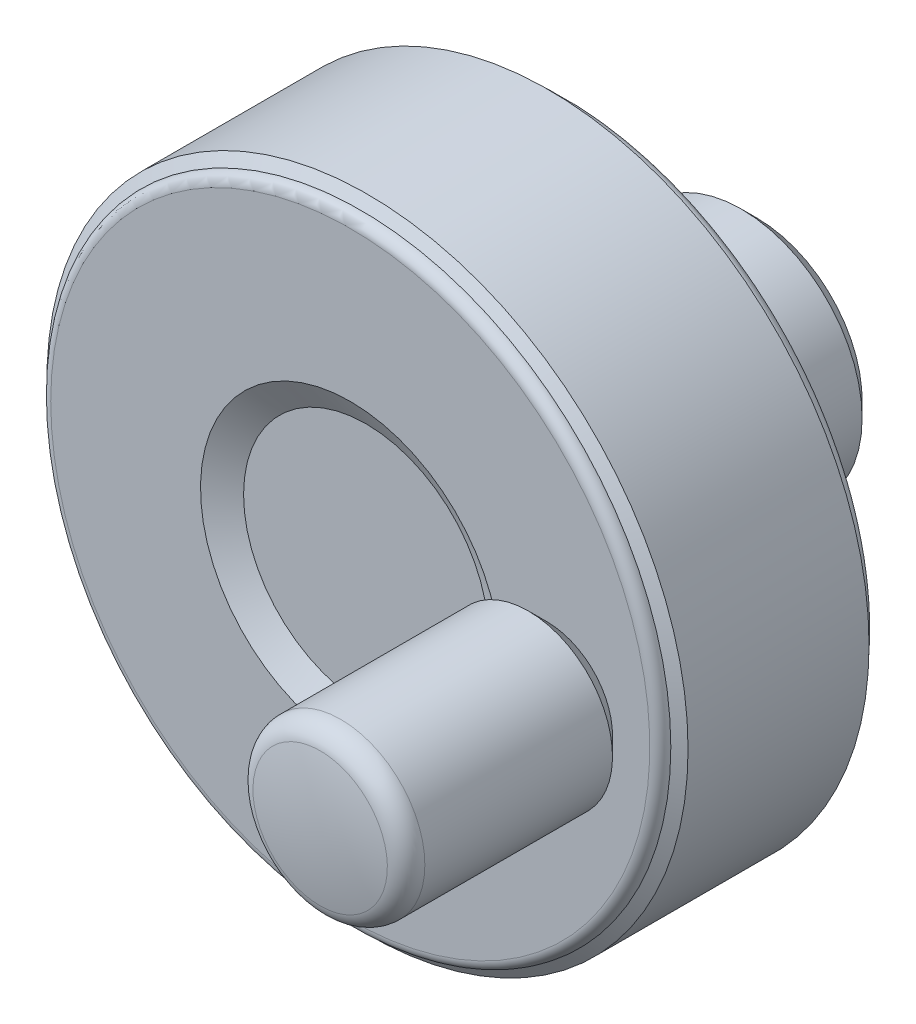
ISO-10303-21;
HEADER;
FILE_DESCRIPTION(('STEP AP214'),'2;1');
FILE_NAME('part.step','',(''),(''),'','','');
FILE_SCHEMA(('AUTOMOTIVE_DESIGN { 1 0 10303 214 1 1 1 1 }'));
ENDSEC;
DATA;
#1=APPLICATION_CONTEXT('core data for automotive mechanical design processes');
#2=APPLICATION_PROTOCOL_DEFINITION('international standard','automotive_design',2000,#1);
#3=PRODUCT_CONTEXT('',#1,'mechanical');
#4=PRODUCT('Part','Part','',(#3));
#5=PRODUCT_RELATED_PRODUCT_CATEGORY('part','',(#4));
#6=PRODUCT_DEFINITION_FORMATION('','',#4);
#7=PRODUCT_DEFINITION_CONTEXT('part definition',#1,'design');
#8=PRODUCT_DEFINITION('design','',#6,#7);
#9=PRODUCT_DEFINITION_SHAPE('','',#8);
#10=(LENGTH_UNIT() NAMED_UNIT(*) SI_UNIT(.MILLI.,.METRE.));
#11=(NAMED_UNIT(*) PLANE_ANGLE_UNIT() SI_UNIT($,.RADIAN.));
#12=(NAMED_UNIT(*) SI_UNIT($,.STERADIAN.) SOLID_ANGLE_UNIT());
#13=UNCERTAINTY_MEASURE_WITH_UNIT(LENGTH_MEASURE(1.E-05),#10,'distance_accuracy_value','');
#14=(GEOMETRIC_REPRESENTATION_CONTEXT(3) GLOBAL_UNCERTAINTY_ASSIGNED_CONTEXT((#13)) GLOBAL_UNIT_ASSIGNED_CONTEXT((#10,
#11,#12)) REPRESENTATION_CONTEXT('',''));
#15=CARTESIAN_POINT('',(0.,0.,0.));
#16=DIRECTION('',(0.,0.,1.));
#17=DIRECTION('',(1.,0.,0.));
#18=AXIS2_PLACEMENT_3D('',#15,#16,#17);
#19=CARTESIAN_POINT('',(-9.,0.,4.55662432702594));
#20=DIRECTION('',(0.,-0.5,-0.866025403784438));
#21=DIRECTION('',(0.,-0.866025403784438,0.5));
#22=AXIS2_PLACEMENT_3D('',#19,#20,#21);
#23=PLANE('',#22);
#24=DIRECTION('',(1.,0.,0.));
#25=VECTOR('',#24,1.);
#26=CARTESIAN_POINT('',(-9.,-1.25,5.27831216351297));
#27=LINE('',#26,#25);
#28=CARTESIAN_POINT('',(-11.5,-1.25,5.27831216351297));
#29=VERTEX_POINT('',#28);
#30=CARTESIAN_POINT('',(-9.,-1.25,5.27831216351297));
#31=VERTEX_POINT('',#30);
#32=EDGE_CURVE('E84',#29,#31,#27,.T.);
#33=ORIENTED_EDGE('',*,*,#32,.T.);
#34=DIRECTION('',(0.,-0.866025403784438,0.5));
#35=VECTOR('',#34,1.);
#36=CARTESIAN_POINT('',(-9.,0.,4.55662432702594));
#37=LINE('',#36,#35);
#38=CARTESIAN_POINT('',(-9.,0.,4.55662432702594));
#39=VERTEX_POINT('',#38);
#40=EDGE_CURVE('E72',#39,#31,#37,.T.);
#41=ORIENTED_EDGE('',*,*,#40,.F.);
#42=DIRECTION('',(-1.,0.,0.));
#43=VECTOR('',#42,1.);
#44=CARTESIAN_POINT('',(-9.,0.,4.55662432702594));
#45=LINE('',#44,#43);
#46=CARTESIAN_POINT('',(-11.5,0.,4.55662432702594));
#47=VERTEX_POINT('',#46);
#48=EDGE_CURVE('E288',#39,#47,#45,.T.);
#49=ORIENTED_EDGE('',*,*,#48,.T.);
#50=DIRECTION('',(0.,-0.866025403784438,0.5));
#51=VECTOR('',#50,1.);
#52=CARTESIAN_POINT('',(-11.5,0.,4.55662432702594));
#53=LINE('',#52,#51);
#54=EDGE_CURVE('E67',#29,#47,#53,.F.);
#55=ORIENTED_EDGE('',*,*,#54,.F.);
#56=EDGE_LOOP('',(#33,#41,#49,#55));
#57=FACE_BOUND('',#56,.T.);
#58=ADVANCED_FACE('F14',(#57),#23,.F.);
#59=CARTESIAN_POINT('',(-9.,-1.25,5.27831216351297));
#60=DIRECTION('',(0.,-1.,0.));
#61=DIRECTION('',(1.,0.,0.));
#62=AXIS2_PLACEMENT_3D('',#59,#60,#61);
#63=PLANE('',#62);
#64=DIRECTION('',(-1.,0.,0.));
#65=VECTOR('',#64,1.);
#66=CARTESIAN_POINT('',(-9.,-1.25,6.72168783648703));
#67=LINE('',#66,#65);
#68=CARTESIAN_POINT('',(-11.5,-1.25,6.72168783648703));
#69=VERTEX_POINT('',#68);
#70=CARTESIAN_POINT('',(-9.,-1.25,6.72168783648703));
#71=VERTEX_POINT('',#70);
#72=EDGE_CURVE('E86',#69,#71,#67,.F.);
#73=ORIENTED_EDGE('',*,*,#72,.T.);
#74=DIRECTION('',(0.,0.,1.));
#75=VECTOR('',#74,1.);
#76=CARTESIAN_POINT('',(-9.,-1.25,5.27831216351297));
#77=LINE('',#76,#75);
#78=EDGE_CURVE('E75',#31,#71,#77,.T.);
#79=ORIENTED_EDGE('',*,*,#78,.F.);
#80=ORIENTED_EDGE('',*,*,#32,.F.);
#81=DIRECTION('',(0.,0.,1.));
#82=VECTOR('',#81,1.);
#83=CARTESIAN_POINT('',(-11.5,-1.25,5.27831216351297));
#84=LINE('',#83,#82);
#85=EDGE_CURVE('E88',#69,#29,#84,.F.);
#86=ORIENTED_EDGE('',*,*,#85,.F.);
#87=EDGE_LOOP('',(#73,#79,#80,#86));
#88=FACE_BOUND('',#87,.T.);
#89=ADVANCED_FACE('F83',(#88),#63,.F.);
#90=CARTESIAN_POINT('',(-9.,1.25,5.27831216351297));
#91=DIRECTION('',(0.,0.5,-0.866025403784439));
#92=DIRECTION('',(0.,-0.866025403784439,-0.5));
#93=AXIS2_PLACEMENT_3D('',#90,#91,#92);
#94=PLANE('',#93);
#95=ORIENTED_EDGE('',*,*,#48,.F.);
#96=DIRECTION('',(0.,-0.86602540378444,-0.5));
#97=VECTOR('',#96,1.);
#98=CARTESIAN_POINT('',(-9.,1.25,5.27831216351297));
#99=LINE('',#98,#97);
#100=CARTESIAN_POINT('',(-9.,1.25,5.27831216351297));
#101=VERTEX_POINT('',#100);
#102=EDGE_CURVE('E78',#101,#39,#99,.T.);
#103=ORIENTED_EDGE('',*,*,#102,.F.);
#104=DIRECTION('',(-1.,0.,0.));
#105=VECTOR('',#104,1.);
#106=CARTESIAN_POINT('',(-9.,1.25,5.27831216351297));
#107=LINE('',#106,#105);
#108=CARTESIAN_POINT('',(-11.5,1.25,5.27831216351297));
#109=VERTEX_POINT('',#108);
#110=EDGE_CURVE('E276',#101,#109,#107,.T.);
#111=ORIENTED_EDGE('',*,*,#110,.T.);
#112=DIRECTION('',(0.,-0.866025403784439,-0.5));
#113=VECTOR('',#112,1.);
#114=CARTESIAN_POINT('',(-11.5,1.25,5.27831216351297));
#115=LINE('',#114,#113);
#116=EDGE_CURVE('E286',#47,#109,#115,.F.);
#117=ORIENTED_EDGE('',*,*,#116,.F.);
#118=EDGE_LOOP('',(#95,#103,#111,#117));
#119=FACE_BOUND('',#118,.T.);
#120=ADVANCED_FACE('F303',(#119),#94,.F.);
#121=CARTESIAN_POINT('',(-9.,-1.25,6.72168783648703));
#122=DIRECTION('',(0.,-0.5,0.866025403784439));
#123=DIRECTION('',(0.,0.866025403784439,0.5));
#124=AXIS2_PLACEMENT_3D('',#121,#122,#123);
#125=PLANE('',#124);
#126=DIRECTION('',(-1.,0.,0.));
#127=VECTOR('',#126,1.);
#128=CARTESIAN_POINT('',(-9.,0.,7.44337567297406));
#129=LINE('',#128,#127);
#130=CARTESIAN_POINT('',(-11.5,0.,7.44337567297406));
#131=VERTEX_POINT('',#130);
#132=CARTESIAN_POINT('',(-9.,0.,7.44337567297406));
#133=VERTEX_POINT('',#132);
#134=EDGE_CURVE('E272',#131,#133,#129,.F.);
#135=ORIENTED_EDGE('',*,*,#134,.T.);
#136=DIRECTION('',(0.,0.86602540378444,0.5));
#137=VECTOR('',#136,1.);
#138=CARTESIAN_POINT('',(-9.,-1.25,6.72168783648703));
#139=LINE('',#138,#137);
#140=EDGE_CURVE('E281',#71,#133,#139,.T.);
#141=ORIENTED_EDGE('',*,*,#140,.F.);
#142=ORIENTED_EDGE('',*,*,#72,.F.);
#143=DIRECTION('',(0.,0.866025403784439,0.5));
#144=VECTOR('',#143,1.);
#145=CARTESIAN_POINT('',(-11.5,-1.25,6.72168783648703));
#146=LINE('',#145,#144);
#147=EDGE_CURVE('E34',#131,#69,#146,.F.);
#148=ORIENTED_EDGE('',*,*,#147,.F.);
#149=EDGE_LOOP('',(#135,#141,#142,#148));
#150=FACE_BOUND('',#149,.T.);
#151=ADVANCED_FACE('F293',(#150),#125,.F.);
#152=CARTESIAN_POINT('',(-9.,0.,0.));
#153=DIRECTION('',(-1.,0.,0.));
#154=DIRECTION('',(0.,-1.,0.));
#155=AXIS2_PLACEMENT_3D('',#152,#153,#154);
#156=PLANE('',#155);
#157=ORIENTED_EDGE('',*,*,#78,.T.);
#158=ORIENTED_EDGE('',*,*,#140,.T.);
#159=DIRECTION('',(0.,0.866025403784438,-0.5));
#160=VECTOR('',#159,1.);
#161=CARTESIAN_POINT('',(-9.,0.,7.44337567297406));
#162=LINE('',#161,#160);
#163=CARTESIAN_POINT('',(-9.,1.25,6.72168783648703));
#164=VERTEX_POINT('',#163);
#165=EDGE_CURVE('E269',#133,#164,#162,.T.);
#166=ORIENTED_EDGE('',*,*,#165,.T.);
#167=DIRECTION('',(0.,0.,1.));
#168=VECTOR('',#167,1.);
#169=CARTESIAN_POINT('',(-9.,1.25,6.72168783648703));
#170=LINE('',#169,#168);
#171=EDGE_CURVE('E279',#164,#101,#170,.F.);
#172=ORIENTED_EDGE('',*,*,#171,.T.);
#173=ORIENTED_EDGE('',*,*,#102,.T.);
#174=ORIENTED_EDGE('',*,*,#40,.T.);
#175=EDGE_LOOP('',(#157,#158,#166,#172,#173,#174));
#176=FACE_BOUND('',#175,.T.);
#177=ADVANCED_FACE('F74',(#176),#156,.T.);
#178=CARTESIAN_POINT('',(-9.,1.25,6.72168783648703));
#179=DIRECTION('',(0.,1.,0.));
#180=DIRECTION('',(-1.,0.,0.));
#181=AXIS2_PLACEMENT_3D('',#178,#179,#180);
#182=PLANE('',#181);
#183=ORIENTED_EDGE('',*,*,#110,.F.);
#184=ORIENTED_EDGE('',*,*,#171,.F.);
#185=DIRECTION('',(-1.,0.,0.));
#186=VECTOR('',#185,1.);
#187=CARTESIAN_POINT('',(-9.,1.25,6.72168783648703));
#188=LINE('',#187,#186);
#189=CARTESIAN_POINT('',(-11.5,1.25,6.72168783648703));
#190=VERTEX_POINT('',#189);
#191=EDGE_CURVE('E266',#164,#190,#188,.T.);
#192=ORIENTED_EDGE('',*,*,#191,.T.);
#193=DIRECTION('',(0.,0.,1.));
#194=VECTOR('',#193,1.);
#195=CARTESIAN_POINT('',(-11.5,1.25,6.72168783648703));
#196=LINE('',#195,#194);
#197=EDGE_CURVE('E274',#109,#190,#196,.T.);
#198=ORIENTED_EDGE('',*,*,#197,.F.);
#199=EDGE_LOOP('',(#183,#184,#192,#198));
#200=FACE_BOUND('',#199,.T.);
#201=ADVANCED_FACE('F301',(#200),#182,.F.);
#202=CARTESIAN_POINT('',(-9.,0.,7.44337567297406));
#203=DIRECTION('',(0.,0.5,0.866025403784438));
#204=DIRECTION('',(0.,0.866025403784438,-0.5));
#205=AXIS2_PLACEMENT_3D('',#202,#203,#204);
#206=PLANE('',#205);
#207=ORIENTED_EDGE('',*,*,#191,.F.);
#208=ORIENTED_EDGE('',*,*,#165,.F.);
#209=ORIENTED_EDGE('',*,*,#134,.F.);
#210=DIRECTION('',(0.,0.866025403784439,-0.5));
#211=VECTOR('',#210,1.);
#212=CARTESIAN_POINT('',(-11.5,0.,7.44337567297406));
#213=LINE('',#212,#211);
#214=EDGE_CURVE('E262',#131,#190,#213,.T.);
#215=ORIENTED_EDGE('',*,*,#214,.T.);
#216=EDGE_LOOP('',(#207,#208,#209,#215));
#217=FACE_BOUND('',#216,.T.);
#218=ADVANCED_FACE('F297',(#217),#206,.F.);
#219=CARTESIAN_POINT('',(0.,0.,23.));
#220=DIRECTION('',(0.,0.,1.));
#221=DIRECTION('',(1.,0.,0.));
#222=AXIS2_PLACEMENT_3D('',#219,#220,#221);
#223=CYLINDRICAL_SURFACE('',#222,4.00000000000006);
#224=CARTESIAN_POINT('',(0.,0.,0.));
#225=DIRECTION('',(0.,0.,1.));
#226=DIRECTION('',(1.,0.,0.));
#227=AXIS2_PLACEMENT_3D('',#224,#225,#226);
#228=CIRCLE('',#227,4.00000000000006);
#229=CARTESIAN_POINT('',(4.00000000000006,0.,0.));
#230=VERTEX_POINT('',#229);
#231=EDGE_CURVE('E265',#230,#230,#228,.F.);
#232=ORIENTED_EDGE('',*,*,#231,.T.);
#233=EDGE_LOOP('',(#232));
#234=FACE_BOUND('',#233,.T.);
#235=CARTESIAN_POINT('',(0.,0.,20.));
#236=DIRECTION('',(0.,0.,-1.));
#237=DIRECTION('',(-1.,0.,0.));
#238=AXIS2_PLACEMENT_3D('',#235,#236,#237);
#239=CIRCLE('',#238,4.00000000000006);
#240=CARTESIAN_POINT('',(-4.00000000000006,0.,20.));
#241=VERTEX_POINT('',#240);
#242=EDGE_CURVE('E611',#241,#241,#239,.T.);
#243=ORIENTED_EDGE('',*,*,#242,.F.);
#244=EDGE_LOOP('',(#243));
#245=FACE_BOUND('',#244,.T.);
#246=ADVANCED_FACE('F363',(#234,#245),#223,.F.);
#247=CARTESIAN_POINT('',(-11.5,0.,8.0095));
#248=DIRECTION('',(1.,0.,0.));
#249=DIRECTION('',(0.,1.,0.));
#250=AXIS2_PLACEMENT_3D('',#247,#248,#249);
#251=PLANE('',#250);
#252=CARTESIAN_POINT('',(-11.5000000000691,0.,6.));
#253=DIRECTION('',(1.,0.,0.));
#254=DIRECTION('',(0.,1.,0.));
#255=AXIS2_PLACEMENT_3D('',#252,#253,#254);
#256=CIRCLE('',#255,2.00949999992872);
#257=CARTESIAN_POINT('',(-11.5000000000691,2.00949999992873,6.));
#258=VERTEX_POINT('',#257);
#259=EDGE_CURVE('E641',#258,#258,#256,.T.);
#260=ORIENTED_EDGE('',*,*,#259,.F.);
#261=EDGE_LOOP('',(#260));
#262=FACE_BOUND('',#261,.T.);
#263=ORIENTED_EDGE('',*,*,#147,.T.);
#264=ORIENTED_EDGE('',*,*,#85,.T.);
#265=ORIENTED_EDGE('',*,*,#54,.T.);
#266=ORIENTED_EDGE('',*,*,#116,.T.);
#267=ORIENTED_EDGE('',*,*,#197,.T.);
#268=ORIENTED_EDGE('',*,*,#214,.F.);
#269=EDGE_LOOP('',(#263,#264,#265,#266,#267,#268));
#270=FACE_BOUND('',#269,.T.);
#271=ADVANCED_FACE('F290',(#262,#270),#251,.F.);
#272=CARTESIAN_POINT('',(-7.5,0.,0.));
#273=DIRECTION('',(0.,0.,1.));
#274=DIRECTION('',(1.,0.,0.));
#275=AXIS2_PLACEMENT_3D('',#272,#273,#274);
#276=PLANE('',#275);
#277=CARTESIAN_POINT('',(0.,0.,0.));
#278=DIRECTION('',(0.,0.,1.));
#279=DIRECTION('',(1.,0.,0.));
#280=AXIS2_PLACEMENT_3D('',#277,#278,#279);
#281=CIRCLE('',#280,7.5);
#282=CARTESIAN_POINT('',(7.5,0.,0.));
#283=VERTEX_POINT('',#282);
#284=EDGE_CURVE('E259',#283,#283,#281,.T.);
#285=ORIENTED_EDGE('',*,*,#284,.F.);
#286=EDGE_LOOP('',(#285));
#287=FACE_BOUND('',#286,.T.);
#288=ORIENTED_EDGE('',*,*,#231,.F.);
#289=EDGE_LOOP('',(#288));
#290=FACE_BOUND('',#289,.T.);
#291=ADVANCED_FACE('F382',(#287,#290),#276,.F.);
#292=CARTESIAN_POINT('',(-11.009500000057,0.,6.));
#293=DIRECTION('',(1.,0.,0.));
#294=DIRECTION('',(0.,1.,0.));
#295=AXIS2_PLACEMENT_3D('',#292,#293,#294);
#296=CONICAL_SURFACE('',#295,2.49999999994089,0.785398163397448);
#297=CARTESIAN_POINT('',(-11.0095,0.,6.));
#298=DIRECTION('',(1.,0.,0.));
#299=DIRECTION('',(0.,1.,0.));
#300=AXIS2_PLACEMENT_3D('',#297,#298,#299);
#301=CIRCLE('',#300,2.5);
#302=CARTESIAN_POINT('',(-11.0095,2.50000000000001,6.));
#303=VERTEX_POINT('',#302);
#304=EDGE_CURVE('E256',#303,#303,#301,.T.);
#305=ORIENTED_EDGE('',*,*,#304,.F.);
#306=EDGE_LOOP('',(#305));
#307=FACE_BOUND('',#306,.T.);
#308=ORIENTED_EDGE('',*,*,#259,.T.);
#309=EDGE_LOOP('',(#308));
#310=FACE_BOUND('',#309,.T.);
#311=ADVANCED_FACE('F391',(#307,#310),#296,.T.);
#312=CARTESIAN_POINT('',(0.,0.,23.));
#313=DIRECTION('',(0.,0.,1.));
#314=DIRECTION('',(1.,0.,0.));
#315=AXIS2_PLACEMENT_3D('',#312,#313,#314);
#316=CYLINDRICAL_SURFACE('',#315,7.5);
#317=CARTESIAN_POINT('',(0.,0.,0.3));
#318=DIRECTION('',(0.,0.,1.));
#319=DIRECTION('',(1.,0.,0.));
#320=AXIS2_PLACEMENT_3D('',#317,#318,#319);
#321=CIRCLE('',#320,7.5);
#322=CARTESIAN_POINT('',(7.5,0.,0.3));
#323=VERTEX_POINT('',#322);
#324=EDGE_CURVE('E253',#323,#323,#321,.F.);
#325=ORIENTED_EDGE('',*,*,#324,.T.);
#326=EDGE_LOOP('',(#325));
#327=FACE_BOUND('',#326,.T.);
#328=ORIENTED_EDGE('',*,*,#284,.T.);
#329=EDGE_LOOP('',(#328));
#330=FACE_BOUND('',#329,.T.);
#331=ADVANCED_FACE('F400',(#327,#330),#316,.T.);
#332=CARTESIAN_POINT('',(-11.5,0.,6.));
#333=DIRECTION('',(1.,0.,0.));
#334=DIRECTION('',(0.,1.,0.));
#335=AXIS2_PLACEMENT_3D('',#332,#333,#334);
#336=CYLINDRICAL_SURFACE('',#335,2.5);
#337=CARTESIAN_POINT('',(-7.49999999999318,0.,6.));
#338=DIRECTION('',(-1.,0.,0.));
#339=DIRECTION('',(0.,-1.,0.));
#340=AXIS2_PLACEMENT_3D('',#337,#338,#339);
#341=CIRCLE('',#340,2.49999999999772);
#342=CARTESIAN_POINT('',(-7.49999999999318,-2.49999999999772,6.));
#343=VERTEX_POINT('',#342);
#344=EDGE_CURVE('E250',#343,#343,#341,.T.);
#345=ORIENTED_EDGE('',*,*,#344,.T.);
#346=EDGE_LOOP('',(#345));
#347=FACE_BOUND('',#346,.T.);
#348=ORIENTED_EDGE('',*,*,#304,.T.);
#349=EDGE_LOOP('',(#348));
#350=FACE_BOUND('',#349,.T.);
#351=ADVANCED_FACE('F410',(#347,#350),#336,.T.);
#352=CARTESIAN_POINT('',(-10.,0.,0.3));
#353=DIRECTION('',(0.,0.,1.));
#354=DIRECTION('',(1.,0.,0.));
#355=AXIS2_PLACEMENT_3D('',#352,#353,#354);
#356=PLANE('',#355);
#357=CARTESIAN_POINT('',(0.,0.,0.299999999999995));
#358=DIRECTION('',(0.,0.,1.));
#359=DIRECTION('',(0.,1.,0.));
#360=AXIS2_PLACEMENT_3D('',#357,#358,#359);
#361=CIRCLE('',#360,10.);
#362=CARTESIAN_POINT('',(0.,10.,0.299999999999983));
#363=VERTEX_POINT('',#362);
#364=EDGE_CURVE('E244',#363,#363,#361,.T.);
#365=ORIENTED_EDGE('',*,*,#364,.F.);
#366=EDGE_LOOP('',(#365));
#367=FACE_BOUND('',#366,.T.);
#368=ORIENTED_EDGE('',*,*,#324,.F.);
#369=EDGE_LOOP('',(#368));
#370=FACE_BOUND('',#369,.T.);
#371=ADVANCED_FACE('F420',(#367,#370),#356,.F.);
#372=CARTESIAN_POINT('',(-7.77777777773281,0.,6.));
#373=DIRECTION('',(-1.,0.,0.));
#374=DIRECTION('',(0.,-1.,0.));
#375=AXIS2_PLACEMENT_3D('',#372,#373,#374);
#376=CONICAL_SURFACE('',#375,2.77777777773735,0.785398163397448);
#377=ORIENTED_EDGE('',*,*,#344,.F.);
#378=EDGE_LOOP('',(#377));
#379=FACE_BOUND('',#378,.T.);
#380=CARTESIAN_POINT('',(-7.77777777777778,0.,6.));
#381=DIRECTION('',(1.,0.,0.));
#382=DIRECTION('',(0.,1.,0.));
#383=AXIS2_PLACEMENT_3D('',#380,#381,#382);
#384=CIRCLE('',#383,2.77777777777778);
#385=CARTESIAN_POINT('',(-7.77777777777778,2.77777777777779,6.));
#386=VERTEX_POINT('',#385);
#387=EDGE_CURVE('E239',#386,#386,#384,.F.);
#388=ORIENTED_EDGE('',*,*,#387,.T.);
#389=EDGE_LOOP('',(#388));
#390=FACE_BOUND('',#389,.T.);
#391=ADVANCED_FACE('F430',(#379,#390),#376,.F.);
#392=CARTESIAN_POINT('',(0.,0.,1.8));
#393=DIRECTION('',(0.,0.,1.));
#394=DIRECTION('',(0.,1.,0.));
#395=AXIS2_PLACEMENT_3D('',#392,#393,#394);
#396=CONICAL_SURFACE('',#395,11.5,0.785398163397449);
#397=CARTESIAN_POINT('',(0.,0.,1.8));
#398=DIRECTION('',(0.,0.,1.));
#399=DIRECTION('',(1.,0.,0.));
#400=AXIS2_PLACEMENT_3D('',#397,#398,#399);
#401=CIRCLE('',#400,11.5);
#402=CARTESIAN_POINT('',(11.5,0.,1.8));
#403=VERTEX_POINT('',#402);
#404=EDGE_CURVE('E236',#403,#403,#401,.T.);
#405=ORIENTED_EDGE('',*,*,#404,.F.);
#406=EDGE_LOOP('',(#405));
#407=FACE_BOUND('',#406,.T.);
#408=ORIENTED_EDGE('',*,*,#364,.T.);
#409=EDGE_LOOP('',(#408));
#410=FACE_BOUND('',#409,.T.);
#411=ADVANCED_FACE('F440',(#407,#410),#396,.T.);
#412=CARTESIAN_POINT('',(-11.5,0.,6.));
#413=DIRECTION('',(1.,0.,0.));
#414=DIRECTION('',(0.,1.,0.));
#415=AXIS2_PLACEMENT_3D('',#412,#413,#414);
#416=CYLINDRICAL_SURFACE('',#415,2.77777777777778);
#417=ORIENTED_EDGE('',*,*,#387,.F.);
#418=EDGE_LOOP('',(#417));
#419=FACE_BOUND('',#418,.T.);
#420=CARTESIAN_POINT('',(-11.4991769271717,-0.137588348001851,8.77436820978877));
#421=CARTESIAN_POINT('',(-11.497332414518,-0.291518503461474,8.76672962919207));
#422=CARTESIAN_POINT('',(-11.4923786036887,-0.444829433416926,8.74624550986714));
#423=CARTESIAN_POINT('',(-11.4767873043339,-0.74572403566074,8.68024322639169));
#424=CARTESIAN_POINT('',(-11.4661460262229,-0.893303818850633,8.63470837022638));
#425=CARTESIAN_POINT('',(-11.4403621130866,-1.17838265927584,8.52012554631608));
#426=CARTESIAN_POINT('',(-11.4252250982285,-1.31589403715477,8.45110692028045));
#427=CARTESIAN_POINT('',(-11.3920663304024,-1.57741062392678,8.29157013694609));
#428=CARTESIAN_POINT('',(-11.3740445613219,-1.701415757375,8.20105185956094));
#429=CARTESIAN_POINT('',(-11.3366898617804,-1.93486629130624,7.99914550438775));
#430=CARTESIAN_POINT('',(-11.3173391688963,-2.04400942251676,7.8874110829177));
#431=CARTESIAN_POINT('',(-11.279758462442,-2.24215187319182,7.64713540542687));
#432=CARTESIAN_POINT('',(-11.2615285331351,-2.33114967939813,7.51859288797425));
#433=CARTESIAN_POINT('',(-11.2281031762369,-2.48719719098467,7.24686057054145));
#434=CARTESIAN_POINT('',(-11.2129365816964,-2.55404183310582,7.10354918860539));
#435=CARTESIAN_POINT('',(-11.1876672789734,-2.66256115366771,6.80727545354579));
#436=CARTESIAN_POINT('',(-11.1775636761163,-2.70424027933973,6.65431481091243));
#437=CARTESIAN_POINT('',(-11.1638303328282,-2.76038356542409,6.34673273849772));
#438=CARTESIAN_POINT('',(-11.160061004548,-2.77543492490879,6.19222475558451));
#439=CARTESIAN_POINT('',(-11.1590213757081,-2.77961338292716,5.88284740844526));
#440=CARTESIAN_POINT('',(-11.1617503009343,-2.7687435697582,5.72797808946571));
#441=CARTESIAN_POINT('',(-11.1732592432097,-2.72191664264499,5.425348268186));
#442=CARTESIAN_POINT('',(-11.1819235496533,-2.68643909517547,5.27750865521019));
#443=CARTESIAN_POINT('',(-11.2041801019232,-2.59204206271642,4.98991113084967));
#444=CARTESIAN_POINT('',(-11.2177728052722,-2.53312040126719,4.85015397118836));
#445=CARTESIAN_POINT('',(-11.2485966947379,-2.39255132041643,4.58041798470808));
#446=CARTESIAN_POINT('',(-11.2658777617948,-2.31058689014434,4.45061024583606));
#447=CARTESIAN_POINT('',(-11.3020564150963,-2.12656839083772,4.20635960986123));
#448=CARTESIAN_POINT('',(-11.3209542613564,-2.02451108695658,4.09191919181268));
#449=CARTESIAN_POINT('',(-11.3588184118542,-1.80013506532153,3.87865231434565));
#450=CARTESIAN_POINT('',(-11.3777743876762,-1.6773696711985,3.78029327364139));
#451=CARTESIAN_POINT('',(-11.4131532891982,-1.41675631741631,3.60553487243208));
#452=CARTESIAN_POINT('',(-11.4295762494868,-1.27890856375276,3.52913521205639));
#453=CARTESIAN_POINT('',(-11.4580167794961,-0.992233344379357,3.40074525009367));
#454=CARTESIAN_POINT('',(-11.4700447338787,-0.843432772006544,3.34869732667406));
#455=CARTESIAN_POINT('',(-11.4883806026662,-0.538850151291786,3.27045780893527));
#456=CARTESIAN_POINT('',(-11.4946895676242,-0.383069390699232,3.24426146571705));
#457=CARTESIAN_POINT('',(-11.500785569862,-0.0731525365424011,3.21894573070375));
#458=CARTESIAN_POINT('',(-11.5007326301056,0.0809263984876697,3.21916197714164));
#459=CARTESIAN_POINT('',(-11.494510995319,0.38680280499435,3.24500683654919));
#460=CARTESIAN_POINT('',(-11.488342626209,0.538600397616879,3.27063409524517));
#461=CARTESIAN_POINT('',(-11.4706505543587,0.834219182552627,3.34609870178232));
#462=CARTESIAN_POINT('',(-11.4591763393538,0.978100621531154,3.3957125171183));
#463=CARTESIAN_POINT('',(-11.4321072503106,1.2555366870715,3.51753391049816));
#464=CARTESIAN_POINT('',(-11.4165118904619,1.38909009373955,3.58974415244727));
#465=CARTESIAN_POINT('',(-11.3824821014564,1.64502928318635,3.75640512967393));
#466=CARTESIAN_POINT('',(-11.3639966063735,1.76713438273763,3.85127636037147));
#467=CARTESIAN_POINT('',(-11.3264087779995,1.99391646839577,4.0598736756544));
#468=CARTESIAN_POINT('',(-11.3073063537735,2.09859087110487,4.17360255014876));
#469=CARTESIAN_POINT('',(-11.2701874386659,2.28966376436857,4.41942986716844));
#470=CARTESIAN_POINT('',(-11.2522004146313,2.3756535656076,4.55185100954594));
#471=CARTESIAN_POINT('',(-11.2198302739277,2.52412568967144,4.82968364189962));
#472=CARTESIAN_POINT('',(-11.2054468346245,2.58661011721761,4.97509396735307));
#473=CARTESIAN_POINT('',(-11.1821507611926,2.68553117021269,5.27312779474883));
#474=CARTESIAN_POINT('',(-11.173178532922,2.72225229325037,5.42565201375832));
#475=CARTESIAN_POINT('',(-11.1615573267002,2.76952101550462,5.73492946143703));
#476=CARTESIAN_POINT('',(-11.1589071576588,2.78007354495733,5.89168188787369));
#477=CARTESIAN_POINT('',(-11.160239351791,2.77471714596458,6.20059092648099));
#478=CARTESIAN_POINT('',(-11.1640503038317,2.75949210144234,6.35276064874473));
#479=CARTESIAN_POINT('',(-11.1775239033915,2.70439497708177,6.65229433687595));
#480=CARTESIAN_POINT('',(-11.1871866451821,2.66452250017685,6.79965822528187));
#481=CARTESIAN_POINT('',(-11.2112501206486,2.56137746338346,7.08559165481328));
#482=CARTESIAN_POINT('',(-11.2256528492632,2.49809504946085,7.22415746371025));
#483=CARTESIAN_POINT('',(-11.2575899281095,2.34997613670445,7.48884885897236));
#484=CARTESIAN_POINT('',(-11.2751247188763,2.26513660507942,7.61497269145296));
#485=CARTESIAN_POINT('',(-11.3119197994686,2.0736910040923,7.85472298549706));
#486=CARTESIAN_POINT('',(-11.3312132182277,1.96657380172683,7.96793644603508));
#487=CARTESIAN_POINT('',(-11.3689966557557,1.73484101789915,8.17497628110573));
#488=CARTESIAN_POINT('',(-11.3874865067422,1.61022180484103,8.26879862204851));
#489=CARTESIAN_POINT('',(-11.4218438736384,1.34518843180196,8.43542834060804));
#490=CARTESIAN_POINT('',(-11.4376774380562,1.20460342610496,8.50797138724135));
#491=CARTESIAN_POINT('',(-11.4646461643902,0.912841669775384,8.62823575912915));
#492=CARTESIAN_POINT('',(-11.4757850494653,0.761673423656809,8.67597676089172));
#493=CARTESIAN_POINT('',(-11.490394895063,0.485563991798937,8.73786490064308));
#494=CARTESIAN_POINT('',(-11.4949836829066,0.361766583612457,8.75695588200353));
#495=CARTESIAN_POINT('',(-11.5001230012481,0.112647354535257,8.77830643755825));
#496=CARTESIAN_POINT('',(-11.5006737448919,-0.0126743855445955,8.78056690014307));
#497=CARTESIAN_POINT('',(-11.4991769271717,-0.137588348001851,8.77436820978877));
#498=B_SPLINE_CURVE_WITH_KNOTS('',3,(#420,#421,#422,#423,#424,#425,#426,#427,#428,#429,#430,
#431,#432,#433,#434,#435,#436,#437,#438,#439,#440,#441,#442,#443,#444,#445,#446,#447,#448,#449,
#450,#451,#452,#453,#454,#455,#456,#457,#458,#459,#460,#461,#462,#463,#464,#465,#466,#467,#468,
#469,#470,#471,#472,#473,#474,#475,#476,#477,#478,#479,#480,#481,#482,#483,#484,#485,#486,#487,
#488,#489,#490,#491,#492,#493,#494,#495,#496,#497),.UNSPECIFIED.,.T.,.F.,(4,2,2,2,2,2,2,2,2,2,2,
2,2,2,2,2,2,2,2,2,2,2,2,2,2,2,2,2,2,2,2,2,2,2,2,2,2,2,4),(0.,0.461931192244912,
0.924170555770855,1.38583448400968,1.84750099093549,2.31747789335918,2.78749008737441,
3.26173880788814,3.73590369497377,4.19947540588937,4.66299188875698,5.11772003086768,
5.57249039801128,6.03385224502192,6.4952884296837,6.96838026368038,7.44146563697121,
7.91342584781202,8.38529934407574,8.84530620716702,9.30528855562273,9.7610645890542,
10.21689437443,10.6819484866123,11.1470714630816,11.6215238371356,12.0959337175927,
12.5650186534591,13.0340152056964,13.4907631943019,13.9475185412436,14.4044663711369,
14.8614785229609,15.3304403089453,15.7994995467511,16.2741600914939,16.7484434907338,
17.1233193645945,17.4981754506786),.UNSPECIFIED.);
#499=CARTESIAN_POINT('',(-11.4991769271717,-0.137588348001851,8.77436820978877));
#500=VERTEX_POINT('',#499);
#501=EDGE_CURVE('E233',#500,#500,#498,.T.);
#502=ORIENTED_EDGE('',*,*,#501,.F.);
#503=EDGE_LOOP('',(#502));
#504=FACE_BOUND('',#503,.T.);
#505=ADVANCED_FACE('F450',(#419,#504),#416,.F.);
#506=CARTESIAN_POINT('',(0.,0.,23.));
#507=DIRECTION('',(0.,0.,1.));
#508=DIRECTION('',(1.,0.,0.));
#509=AXIS2_PLACEMENT_3D('',#506,#507,#508);
#510=CYLINDRICAL_SURFACE('',#509,11.5);
#511=CARTESIAN_POINT('',(0.,0.,36.5));
#512=DIRECTION('',(0.,0.,1.));
#513=DIRECTION('',(1.,0.,0.));
#514=AXIS2_PLACEMENT_3D('',#511,#512,#513);
#515=CIRCLE('',#514,11.5);
#516=CARTESIAN_POINT('',(11.5,0.,36.5));
#517=VERTEX_POINT('',#516);
#518=EDGE_CURVE('E224',#517,#517,#515,.T.);
#519=ORIENTED_EDGE('',*,*,#518,.F.);
#520=EDGE_LOOP('',(#519));
#521=FACE_BOUND('',#520,.T.);
#522=ORIENTED_EDGE('',*,*,#501,.T.);
#523=EDGE_LOOP('',(#522));
#524=FACE_BOUND('',#523,.T.);
#525=ORIENTED_EDGE('',*,*,#404,.T.);
#526=EDGE_LOOP('',(#525));
#527=FACE_BOUND('',#526,.T.);
#528=ADVANCED_FACE('F460',(#521,#524,#527),#510,.T.);
#529=CARTESIAN_POINT('',(0.,0.,23.));
#530=DIRECTION('',(0.,0.,1.));
#531=DIRECTION('',(1.,0.,0.));
#532=AXIS2_PLACEMENT_3D('',#529,#530,#531);
#533=CYLINDRICAL_SURFACE('',#532,30.5);
#534=CARTESIAN_POINT('',(0.,0.,37.36));
#535=DIRECTION('',(0.,0.,1.));
#536=DIRECTION('',(1.,0.,0.));
#537=AXIS2_PLACEMENT_3D('',#534,#535,#536);
#538=CIRCLE('',#537,30.5);
#539=CARTESIAN_POINT('',(30.5,0.,37.36));
#540=VERTEX_POINT('',#539);
#541=EDGE_CURVE('E90',#540,#540,#538,.F.);
#542=ORIENTED_EDGE('',*,*,#541,.T.);
#543=EDGE_LOOP('',(#542));
#544=FACE_BOUND('',#543,.T.);
#545=CARTESIAN_POINT('',(0.,0.,20.14));
#546=DIRECTION('',(0.,0.,1.));
#547=DIRECTION('',(1.,0.,0.));
#548=AXIS2_PLACEMENT_3D('',#545,#546,#547);
#549=CIRCLE('',#548,30.5);
#550=CARTESIAN_POINT('',(30.5,0.,20.14));
#551=VERTEX_POINT('',#550);
#552=EDGE_CURVE('E232',#551,#551,#549,.F.);
#553=ORIENTED_EDGE('',*,*,#552,.F.);
#554=EDGE_LOOP('',(#553));
#555=FACE_BOUND('',#554,.T.);
#556=ADVANCED_FACE('F471',(#544,#555),#533,.T.);
#557=CARTESIAN_POINT('',(0.,0.,37.5));
#558=DIRECTION('',(0.,0.,1.));
#559=DIRECTION('',(0.,1.,0.));
#560=AXIS2_PLACEMENT_3D('',#557,#558,#559);
#561=CONICAL_SURFACE('',#560,12.5,0.785398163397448);
#562=CARTESIAN_POINT('',(0.,0.,37.5));
#563=DIRECTION('',(0.,0.,1.));
#564=DIRECTION('',(0.,1.,0.));
#565=AXIS2_PLACEMENT_3D('',#562,#563,#564);
#566=CIRCLE('',#565,12.5);
#567=CARTESIAN_POINT('',(0.,12.5,37.5));
#568=VERTEX_POINT('',#567);
#569=EDGE_CURVE('E249',#568,#568,#566,.F.);
#570=ORIENTED_EDGE('',*,*,#569,.T.);
#571=EDGE_LOOP('',(#570));
#572=FACE_BOUND('',#571,.T.);
#573=ORIENTED_EDGE('',*,*,#518,.T.);
#574=EDGE_LOOP('',(#573));
#575=FACE_BOUND('',#574,.T.);
#576=ADVANCED_FACE('F482',(#572,#575),#561,.T.);
#577=CARTESIAN_POINT('',(0.,0.,20.14));
#578=DIRECTION('',(0.,0.,1.));
#579=DIRECTION('',(0.,1.,0.));
#580=AXIS2_PLACEMENT_3D('',#577,#578,#579);
#581=CONICAL_SURFACE('',#580,30.5,1.00148313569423);
#582=ORIENTED_EDGE('',*,*,#552,.T.);
#583=EDGE_LOOP('',(#582));
#584=FACE_BOUND('',#583,.T.);
#585=CARTESIAN_POINT('',(0.,0.,19.5));
#586=DIRECTION('',(0.,0.,-1.));
#587=DIRECTION('',(-1.,0.,0.));
#588=AXIS2_PLACEMENT_3D('',#585,#586,#587);
#589=CIRCLE('',#588,29.5);
#590=CARTESIAN_POINT('',(-29.5,0.,19.5));
#591=VERTEX_POINT('',#590);
#592=EDGE_CURVE('E209',#591,#591,#589,.T.);
#593=ORIENTED_EDGE('',*,*,#592,.F.);
#594=EDGE_LOOP('',(#593));
#595=FACE_BOUND('',#594,.T.);
#596=ADVANCED_FACE('F492',(#584,#595),#581,.T.);
#597=CARTESIAN_POINT('',(-25.,0.,37.5));
#598=DIRECTION('',(0.,0.,1.));
#599=DIRECTION('',(1.,0.,0.));
#600=AXIS2_PLACEMENT_3D('',#597,#598,#599);
#601=PLANE('',#600);
#602=CARTESIAN_POINT('',(0.,0.,37.5));
#603=DIRECTION('',(0.,0.,-1.));
#604=DIRECTION('',(0.,-1.,0.));
#605=AXIS2_PLACEMENT_3D('',#602,#603,#604);
#606=CIRCLE('',#605,25.);
#607=CARTESIAN_POINT('',(0.,-25.,37.5));
#608=VERTEX_POINT('',#607);
#609=EDGE_CURVE('E620',#608,#608,#606,.T.);
#610=ORIENTED_EDGE('',*,*,#609,.T.);
#611=EDGE_LOOP('',(#610));
#612=FACE_BOUND('',#611,.T.);
#613=ORIENTED_EDGE('',*,*,#569,.F.);
#614=EDGE_LOOP('',(#613));
#615=FACE_BOUND('',#614,.T.);
#616=ADVANCED_FACE('F215',(#612,#615),#601,.F.);
#617=CARTESIAN_POINT('',(0.,0.,19.5));
#618=DIRECTION('',(0.,0.,-1.));
#619=DIRECTION('',(-1.,0.,0.));
#620=AXIS2_PLACEMENT_3D('',#617,#618,#619);
#621=TOROIDAL_SURFACE('',#620,28.5,1.);
#622=CARTESIAN_POINT('',(0.,0.,18.5));
#623=DIRECTION('',(0.,0.,1.));
#624=DIRECTION('',(-1.,0.,0.));
#625=AXIS2_PLACEMENT_3D('',#622,#623,#624);
#626=CIRCLE('',#625,28.5);
#627=CARTESIAN_POINT('',(-28.5,0.,18.5));
#628=VERTEX_POINT('',#627);
#629=EDGE_CURVE('E617',#628,#628,#626,.T.);
#630=ORIENTED_EDGE('',*,*,#629,.T.);
#631=EDGE_LOOP('',(#630));
#632=FACE_BOUND('',#631,.T.);
#633=ORIENTED_EDGE('',*,*,#592,.T.);
#634=EDGE_LOOP('',(#633));
#635=FACE_BOUND('',#634,.T.);
#636=ADVANCED_FACE('F211',(#632,#635),#621,.T.);
#637=CARTESIAN_POINT('',(0.,0.,36.5));
#638=DIRECTION('',(0.,0.,-1.));
#639=DIRECTION('',(0.,-1.,0.));
#640=AXIS2_PLACEMENT_3D('',#637,#638,#639);
#641=CONICAL_SURFACE('',#640,26.,0.785398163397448);
#642=CARTESIAN_POINT('',(0.,0.,36.5));
#643=DIRECTION('',(0.,0.,1.));
#644=DIRECTION('',(1.,0.,0.));
#645=AXIS2_PLACEMENT_3D('',#642,#643,#644);
#646=CIRCLE('',#645,26.);
#647=CARTESIAN_POINT('',(26.,0.,36.5));
#648=VERTEX_POINT('',#647);
#649=EDGE_CURVE('E25',#648,#648,#646,.F.);
#650=ORIENTED_EDGE('',*,*,#649,.T.);
#651=EDGE_LOOP('',(#650));
#652=FACE_BOUND('',#651,.T.);
#653=ORIENTED_EDGE('',*,*,#609,.F.);
#654=EDGE_LOOP('',(#653));
#655=FACE_BOUND('',#654,.T.);
#656=ADVANCED_FACE('F185',(#652,#655),#641,.F.);
#657=CARTESIAN_POINT('',(-28.5,0.,18.5));
#658=DIRECTION('',(0.,0.,1.));
#659=DIRECTION('',(1.,0.,0.));
#660=AXIS2_PLACEMENT_3D('',#657,#658,#659);
#661=PLANE('',#660);
#662=ORIENTED_EDGE('',*,*,#629,.F.);
#663=EDGE_LOOP('',(#662));
#664=FACE_BOUND('',#663,.T.);
#665=CARTESIAN_POINT('',(0.,0.,18.5));
#666=DIRECTION('',(0.,0.,1.));
#667=DIRECTION('',(1.,0.,0.));
#668=AXIS2_PLACEMENT_3D('',#665,#666,#667);
#669=CIRCLE('',#668,26.);
#670=CARTESIAN_POINT('',(26.,0.,18.5));
#671=VERTEX_POINT('',#670);
#672=EDGE_CURVE('E9',#671,#671,#669,.T.);
#673=ORIENTED_EDGE('',*,*,#672,.T.);
#674=EDGE_LOOP('',(#673));
#675=FACE_BOUND('',#674,.T.);
#676=ADVANCED_FACE('F177',(#664,#675),#661,.F.);
#677=CARTESIAN_POINT('',(0.,0.,23.));
#678=DIRECTION('',(0.,0.,1.));
#679=DIRECTION('',(1.,0.,0.));
#680=AXIS2_PLACEMENT_3D('',#677,#678,#679);
#681=CYLINDRICAL_SURFACE('',#680,26.);
#682=ORIENTED_EDGE('',*,*,#672,.F.);
#683=EDGE_LOOP('',(#682));
#684=FACE_BOUND('',#683,.T.);
#685=ORIENTED_EDGE('',*,*,#649,.F.);
#686=EDGE_LOOP('',(#685));
#687=FACE_BOUND('',#686,.T.);
#688=ADVANCED_FACE('F175',(#684,#687),#681,.F.);
#689=CARTESIAN_POINT('',(19.5,0.,29.5));
#690=DIRECTION('',(0.,-1.,0.));
#691=DIRECTION('',(-1.,0.,0.));
#692=AXIS2_PLACEMENT_3D('',#689,#690,#691);
#693=SPHERICAL_SURFACE('',#692,32.5000000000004);
#694=CARTESIAN_POINT('',(19.5,0.,61.3649320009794));
#695=DIRECTION('',(0.,0.,-1.));
#696=DIRECTION('',(0.,-1.,0.));
#697=AXIS2_PLACEMENT_3D('',#694,#695,#696);
#698=CIRCLE('',#697,6.39344262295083);
#699=CARTESIAN_POINT('',(19.5,-6.39344262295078,61.3649320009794));
#700=VERTEX_POINT('',#699);
#701=EDGE_CURVE('E19',#700,#700,#698,.T.);
#702=ORIENTED_EDGE('',*,*,#701,.F.);
#703=EDGE_LOOP('',(#702));
#704=FACE_BOUND('',#703,.T.);
#705=ADVANCED_FACE('F16',(#704),#693,.T.);
#706=CARTESIAN_POINT('',(19.5,0.,59.4040131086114));
#707=DIRECTION('',(0.,0.,-1.));
#708=DIRECTION('',(0.,-1.,0.));
#709=AXIS2_PLACEMENT_3D('',#706,#707,#708);
#710=TOROIDAL_SURFACE('',#709,6.00000000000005,2.);
#711=CARTESIAN_POINT('',(19.5,0.,59.4040131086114));
#712=DIRECTION('',(0.,0.,1.));
#713=DIRECTION('',(0.,1.,0.));
#714=AXIS2_PLACEMENT_3D('',#711,#712,#713);
#715=CIRCLE('',#714,8.);
#716=CARTESIAN_POINT('',(19.5,8.00000000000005,59.4040131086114));
#717=VERTEX_POINT('',#716);
#718=EDGE_CURVE('E133',#717,#717,#715,.F.);
#719=ORIENTED_EDGE('',*,*,#718,.F.);
#720=EDGE_LOOP('',(#719));
#721=FACE_BOUND('',#720,.T.);
#722=ORIENTED_EDGE('',*,*,#701,.T.);
#723=EDGE_LOOP('',(#722));
#724=FACE_BOUND('',#723,.T.);
#725=ADVANCED_FACE('F142',(#721,#724),#710,.T.);
#726=CARTESIAN_POINT('',(19.5,0.,39.));
#727=DIRECTION('',(0.,0.,1.));
#728=DIRECTION('',(0.,1.,0.));
#729=AXIS2_PLACEMENT_3D('',#726,#727,#728);
#730=CYLINDRICAL_SURFACE('',#729,8.);
#731=ORIENTED_EDGE('',*,*,#718,.T.);
#732=EDGE_LOOP('',(#731));
#733=FACE_BOUND('',#732,.T.);
#734=CARTESIAN_POINT('',(19.5,0.,41.55));
#735=DIRECTION('',(0.,0.,1.));
#736=DIRECTION('',(0.,1.,0.));
#737=AXIS2_PLACEMENT_3D('',#734,#735,#736);
#738=CIRCLE('',#737,8.);
#739=CARTESIAN_POINT('',(19.5,8.00000000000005,41.55));
#740=VERTEX_POINT('',#739);
#741=EDGE_CURVE('E124',#740,#740,#738,.F.);
#742=ORIENTED_EDGE('',*,*,#741,.F.);
#743=EDGE_LOOP('',(#742));
#744=FACE_BOUND('',#743,.T.);
#745=ADVANCED_FACE('F145',(#733,#744),#730,.T.);
#746=CARTESIAN_POINT('',(19.5,0.,41.55));
#747=DIRECTION('',(0.,0.,1.));
#748=DIRECTION('',(0.,1.,0.));
#749=AXIS2_PLACEMENT_3D('',#746,#747,#748);
#750=CONICAL_SURFACE('',#749,8.,0.785398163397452);
#751=ORIENTED_EDGE('',*,*,#741,.T.);
#752=EDGE_LOOP('',(#751));
#753=FACE_BOUND('',#752,.T.);
#754=CARTESIAN_POINT('',(19.5,0.,39.8));
#755=DIRECTION('',(0.,0.,1.));
#756=DIRECTION('',(0.,1.,0.));
#757=AXIS2_PLACEMENT_3D('',#754,#755,#756);
#758=CIRCLE('',#757,6.25);
#759=CARTESIAN_POINT('',(19.5,6.25000000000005,39.8));
#760=VERTEX_POINT('',#759);
#761=EDGE_CURVE('E132',#760,#760,#758,.T.);
#762=ORIENTED_EDGE('',*,*,#761,.T.);
#763=EDGE_LOOP('',(#762));
#764=FACE_BOUND('',#763,.T.);
#765=ADVANCED_FACE('F149',(#753,#764),#750,.T.);
#766=CARTESIAN_POINT('',(0.,0.,37.5));
#767=DIRECTION('',(0.,0.,-1.));
#768=DIRECTION('',(-1.,0.,0.));
#769=AXIS2_PLACEMENT_3D('',#766,#767,#768);
#770=PLANE('',#769);
#771=CARTESIAN_POINT('',(0.,0.,37.5));
#772=DIRECTION('',(0.,0.,1.));
#773=DIRECTION('',(0.,1.,0.));
#774=AXIS2_PLACEMENT_3D('',#771,#772,#773);
#775=CIRCLE('',#774,11.6519237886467);
#776=CARTESIAN_POINT('',(0.,11.6519237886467,37.5));
#777=VERTEX_POINT('',#776);
#778=EDGE_CURVE('E654',#777,#777,#775,.T.);
#779=ORIENTED_EDGE('',*,*,#778,.T.);
#780=EDGE_LOOP('',(#779));
#781=FACE_BOUND('',#780,.T.);
#782=ADVANCED_FACE('F153',(#781),#770,.F.);
#783=CARTESIAN_POINT('',(19.5,-6.25,39.8));
#784=DIRECTION('',(0.,0.,1.));
#785=DIRECTION('',(0.,1.,0.));
#786=AXIS2_PLACEMENT_3D('',#783,#784,#785);
#787=PLANE('',#786);
#788=ORIENTED_EDGE('',*,*,#761,.F.);
#789=EDGE_LOOP('',(#788));
#790=FACE_BOUND('',#789,.T.);
#791=CARTESIAN_POINT('',(19.5,0.,39.8));
#792=DIRECTION('',(0.,0.,1.));
#793=DIRECTION('',(0.,1.,0.));
#794=AXIS2_PLACEMENT_3D('',#791,#792,#793);
#795=CIRCLE('',#794,3.);
#796=CARTESIAN_POINT('',(19.5,3.00000000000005,39.8));
#797=VERTEX_POINT('',#796);
#798=EDGE_CURVE('E652',#797,#797,#795,.F.);
#799=ORIENTED_EDGE('',*,*,#798,.F.);
#800=EDGE_LOOP('',(#799));
#801=FACE_BOUND('',#800,.T.);
#802=ADVANCED_FACE('F157',(#790,#801),#787,.F.);
#803=CARTESIAN_POINT('',(0.,0.,39.));
#804=DIRECTION('',(0.,0.,1.));
#805=DIRECTION('',(0.,1.,0.));
#806=AXIS2_PLACEMENT_3D('',#803,#804,#805);
#807=CONICAL_SURFACE('',#806,14.25,1.0471975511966);
#808=ORIENTED_EDGE('',*,*,#778,.F.);
#809=EDGE_LOOP('',(#808));
#810=FACE_BOUND('',#809,.T.);
#811=CARTESIAN_POINT('',(0.,0.,39.));
#812=DIRECTION('',(0.,0.,1.));
#813=DIRECTION('',(0.,1.,0.));
#814=AXIS2_PLACEMENT_3D('',#811,#812,#813);
#815=CIRCLE('',#814,14.25);
#816=CARTESIAN_POINT('',(0.,14.25,39.));
#817=VERTEX_POINT('',#816);
#818=EDGE_CURVE('E649',#817,#817,#815,.T.);
#819=ORIENTED_EDGE('',*,*,#818,.T.);
#820=EDGE_LOOP('',(#819));
#821=FACE_BOUND('',#820,.T.);
#822=ADVANCED_FACE('F161',(#810,#821),#807,.F.);
#823=CARTESIAN_POINT('',(19.5,0.,39.));
#824=DIRECTION('',(0.,0.,1.));
#825=DIRECTION('',(0.,1.,0.));
#826=AXIS2_PLACEMENT_3D('',#823,#824,#825);
#827=CYLINDRICAL_SURFACE('',#826,3.);
#828=ORIENTED_EDGE('',*,*,#798,.T.);
#829=EDGE_LOOP('',(#828));
#830=FACE_BOUND('',#829,.T.);
#831=CARTESIAN_POINT('',(19.5,0.,39.));
#832=DIRECTION('',(0.,0.,1.));
#833=DIRECTION('',(0.,1.,0.));
#834=AXIS2_PLACEMENT_3D('',#831,#832,#833);
#835=CIRCLE('',#834,3.);
#836=CARTESIAN_POINT('',(19.5,3.00000000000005,39.));
#837=VERTEX_POINT('',#836);
#838=EDGE_CURVE('E646',#837,#837,#835,.T.);
#839=ORIENTED_EDGE('',*,*,#838,.T.);
#840=EDGE_LOOP('',(#839));
#841=FACE_BOUND('',#840,.T.);
#842=ADVANCED_FACE('F164',(#830,#841),#827,.T.);
#843=CARTESIAN_POINT('',(-14.25,0.,39.));
#844=DIRECTION('',(0.,0.,-1.));
#845=DIRECTION('',(-1.,0.,0.));
#846=AXIS2_PLACEMENT_3D('',#843,#844,#845);
#847=PLANE('',#846);
#848=ORIENTED_EDGE('',*,*,#838,.F.);
#849=EDGE_LOOP('',(#848));
#850=FACE_BOUND('',#849,.T.);
#851=ORIENTED_EDGE('',*,*,#818,.F.);
#852=EDGE_LOOP('',(#851));
#853=FACE_BOUND('',#852,.T.);
#854=CARTESIAN_POINT('',(0.,0.,39.));
#855=DIRECTION('',(0.,0.,-1.));
#856=DIRECTION('',(-1.,0.,0.));
#857=AXIS2_PLACEMENT_3D('',#854,#855,#856);
#858=CIRCLE('',#857,28.5);
#859=CARTESIAN_POINT('',(-28.5,1.68327596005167E-13,39.));
#860=VERTEX_POINT('',#859);
#861=EDGE_CURVE('E99',#860,#860,#858,.T.);
#862=ORIENTED_EDGE('',*,*,#861,.F.);
#863=EDGE_LOOP('',(#862));
#864=FACE_BOUND('',#863,.T.);
#865=ADVANCED_FACE('F113',(#850,#853,#864),#847,.F.);
#866=CARTESIAN_POINT('',(0.,0.,38.));
#867=DIRECTION('',(0.,0.,-1.));
#868=DIRECTION('',(-1.,0.,0.));
#869=AXIS2_PLACEMENT_3D('',#866,#867,#868);
#870=TOROIDAL_SURFACE('',#869,28.5,1.);
#871=CARTESIAN_POINT('',(0.,0.,38.));
#872=DIRECTION('',(0.,0.,-1.));
#873=DIRECTION('',(-1.,0.,0.));
#874=AXIS2_PLACEMENT_3D('',#871,#872,#873);
#875=CIRCLE('',#874,29.5);
#876=CARTESIAN_POINT('',(-29.5,0.,38.));
#877=VERTEX_POINT('',#876);
#878=EDGE_CURVE('E80',#877,#877,#875,.T.);
#879=ORIENTED_EDGE('',*,*,#878,.F.);
#880=EDGE_LOOP('',(#879));
#881=FACE_BOUND('',#880,.T.);
#882=ORIENTED_EDGE('',*,*,#861,.T.);
#883=EDGE_LOOP('',(#882));
#884=FACE_BOUND('',#883,.T.);
#885=ADVANCED_FACE('F107',(#881,#884),#870,.T.);
#886=CARTESIAN_POINT('',(0.,0.,37.36));
#887=DIRECTION('',(0.,0.,-1.));
#888=DIRECTION('',(0.,-1.,0.));
#889=AXIS2_PLACEMENT_3D('',#886,#887,#888);
#890=CONICAL_SURFACE('',#889,30.5,1.00148313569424);
#891=ORIENTED_EDGE('',*,*,#541,.F.);
#892=EDGE_LOOP('',(#891));
#893=FACE_BOUND('',#892,.T.);
#894=ORIENTED_EDGE('',*,*,#878,.T.);
#895=EDGE_LOOP('',(#894));
#896=FACE_BOUND('',#895,.T.);
#897=ADVANCED_FACE('F112',(#893,#896),#890,.T.);
#898=CARTESIAN_POINT('',(0.,0.,20.));
#899=DIRECTION('',(0.,0.,-1.));
#900=DIRECTION('',(-1.,0.,0.));
#901=AXIS2_PLACEMENT_3D('',#898,#899,#900);
#902=PLANE('',#901);
#903=ORIENTED_EDGE('',*,*,#242,.T.);
#904=EDGE_LOOP('',(#903));
#905=FACE_BOUND('',#904,.T.);
#906=ADVANCED_FACE('F191',(#905),#902,.T.);
#907=CLOSED_SHELL('',(#58,#89,#120,#151,#177,#201,#218,#246,#271,#291,#311,#331,#351,#371,#391,
#411,#505,#528,#556,#576,#596,#616,#636,#656,#676,#688,#705,#725,#745,#765,#782,#802,#822,#842,
#865,#885,#897,#906));
#908=MANIFOLD_SOLID_BREP('B1',#907);
#909=ADVANCED_BREP_SHAPE_REPRESENTATION('',(#18,#908),#14);
#910=SHAPE_DEFINITION_REPRESENTATION(#9,#909);
ENDSEC;
END-ISO-10303-21;
